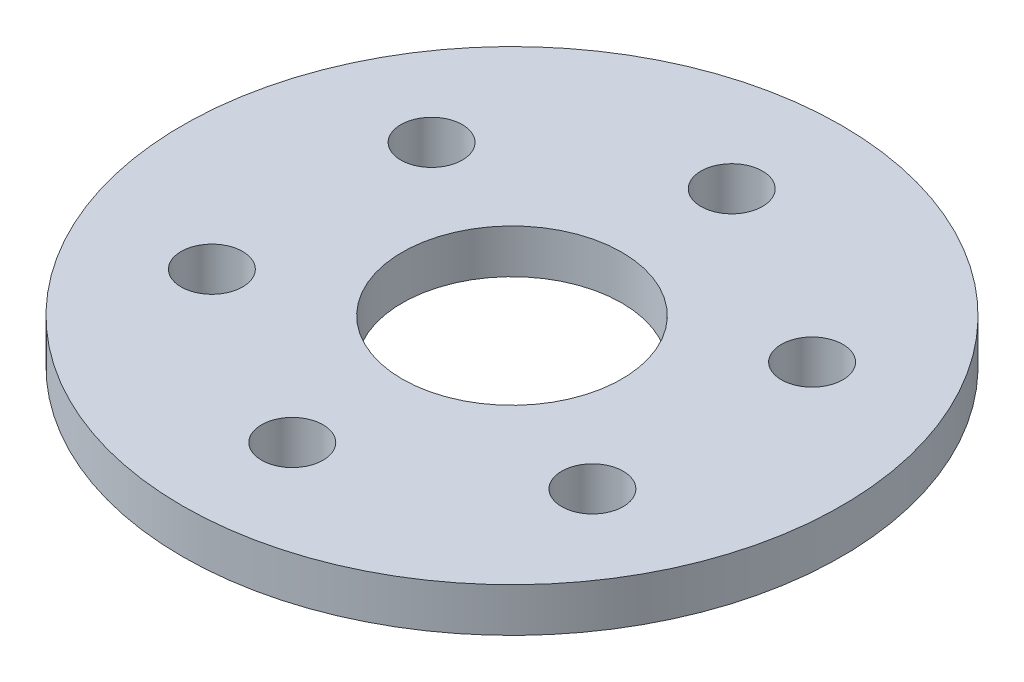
from build123d import *

# Parameters (mm, degrees)
SKETCH1_R             = 37.5
SKETCH1_R_2           = 12.5
EXTRUDE1_DEPTH        = 5
M8X1_0_TAPPED_HOLE1_D = 7
CIRPATTERN1_COUNT     = 6


with BuildPart() as part:
    # Sketch1 → Extrude1 (new body)
    with BuildSketch(Plane(origin=(0, 0, 0), x_dir=(1, 0, 0), z_dir=(0, 1, 0))):
        with Locations(Location((0, 0, 0), (0, 0, 270))):
            Circle(SKETCH1_R)
        with Locations(Location((0, 0, 0), (0, 0, 270))):
            Circle(SKETCH1_R_2, mode=Mode.SUBTRACT)
    extrude(amount=EXTRUDE1_DEPTH)

    # M8x1.0 Tapped Hole1 (through all)
    with Locations(Plane(origin=(-43.867405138, 5, -24.317576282), x_dir=(-1, 0, 0), z_dir=(0, 1, 0))):
        with Locations((-43.867405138, 49.317576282)):
            m8x1_0_tapped_hole1 = Hole(M8X1_0_TAPPED_HOLE1_D / 2)

    # CirPattern1: M8x1.0 Tapped Hole1 ×6 about axis
    cirpattern1_axis = Axis((0, 0, 0), (0, 1, 0))
    for i in range(1, CIRPATTERN1_COUNT):
        add(m8x1_0_tapped_hole1.rotate(cirpattern1_axis, i * 360 / CIRPATTERN1_COUNT), mode=Mode.SUBTRACT)


solid = part.part
